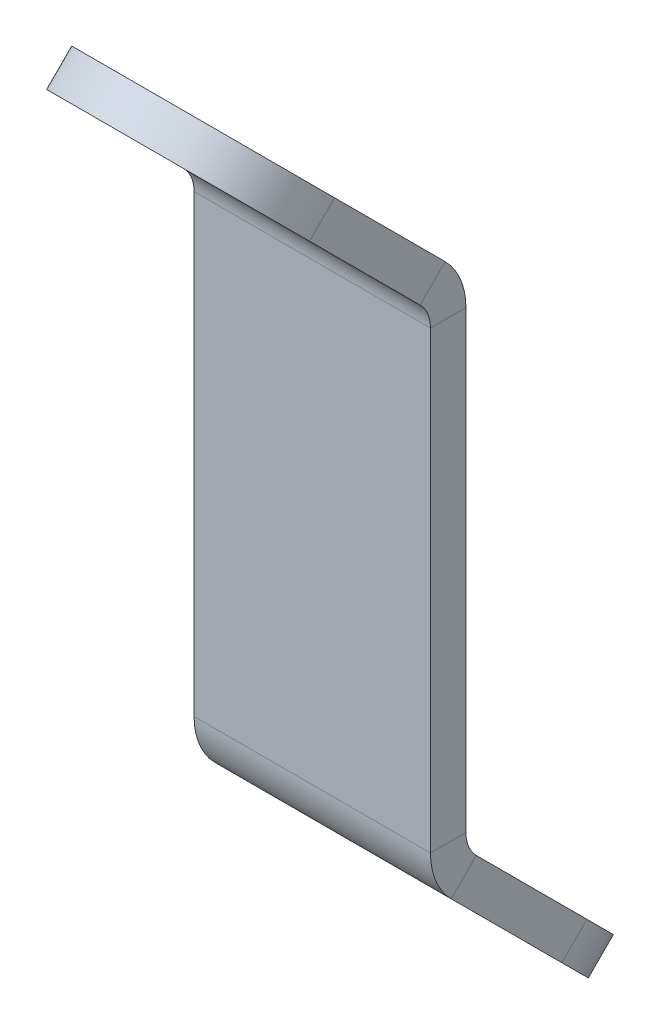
ISO-10303-21;
HEADER;
FILE_DESCRIPTION(('STEP AP214'),'2;1');
FILE_NAME('part.step','',(''),(''),'','','');
FILE_SCHEMA(('AUTOMOTIVE_DESIGN { 1 0 10303 214 1 1 1 1 }'));
ENDSEC;
DATA;
#1=APPLICATION_CONTEXT('core data for automotive mechanical design processes');
#2=APPLICATION_PROTOCOL_DEFINITION('international standard','automotive_design',2000,#1);
#3=PRODUCT_CONTEXT('',#1,'mechanical');
#4=PRODUCT('Part','Part','',(#3));
#5=PRODUCT_RELATED_PRODUCT_CATEGORY('part','',(#4));
#6=PRODUCT_DEFINITION_FORMATION('','',#4);
#7=PRODUCT_DEFINITION_CONTEXT('part definition',#1,'design');
#8=PRODUCT_DEFINITION('design','',#6,#7);
#9=PRODUCT_DEFINITION_SHAPE('','',#8);
#10=(LENGTH_UNIT() NAMED_UNIT(*) SI_UNIT(.MILLI.,.METRE.));
#11=(NAMED_UNIT(*) PLANE_ANGLE_UNIT() SI_UNIT($,.RADIAN.));
#12=(NAMED_UNIT(*) SI_UNIT($,.STERADIAN.) SOLID_ANGLE_UNIT());
#13=UNCERTAINTY_MEASURE_WITH_UNIT(LENGTH_MEASURE(1.E-05),#10,'distance_accuracy_value','');
#14=(GEOMETRIC_REPRESENTATION_CONTEXT(3) GLOBAL_UNCERTAINTY_ASSIGNED_CONTEXT((#13)) GLOBAL_UNIT_ASSIGNED_CONTEXT((#10,
#11,#12)) REPRESENTATION_CONTEXT('',''));
#15=CARTESIAN_POINT('',(0.,0.,0.));
#16=DIRECTION('',(0.,0.,1.));
#17=DIRECTION('',(1.,0.,0.));
#18=AXIS2_PLACEMENT_3D('',#15,#16,#17);
#19=CARTESIAN_POINT('',(0.,3.16746428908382,-8.11440020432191));
#20=DIRECTION('',(0.,0.707106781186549,-0.707106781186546));
#21=DIRECTION('',(-1.,0.,0.));
#22=AXIS2_PLACEMENT_3D('',#19,#20,#21);
#23=CYLINDRICAL_SURFACE('',#22,4.25);
#24=CARTESIAN_POINT('',(0.,3.16746428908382,-8.11440020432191));
#25=DIRECTION('',(0.,-0.707106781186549,0.707106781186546));
#26=DIRECTION('',(1.,0.,0.));
#27=AXIS2_PLACEMENT_3D('',#24,#25,#26);
#28=CIRCLE('',#27,4.25);
#29=CARTESIAN_POINT('',(4.25,3.16746428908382,-8.11440020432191));
#30=VERTEX_POINT('',#29);
#31=EDGE_CURVE('E214',#30,#30,#28,.T.);
#32=ORIENTED_EDGE('',*,*,#31,.T.);
#33=EDGE_LOOP('',(#32));
#34=FACE_BOUND('',#33,.T.);
#35=CARTESIAN_POINT('',(0.,5.28878463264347,-10.2357205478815));
#36=DIRECTION('',(0.,-0.707106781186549,0.707106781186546));
#37=DIRECTION('',(1.,0.,0.));
#38=AXIS2_PLACEMENT_3D('',#35,#36,#37);
#39=CIRCLE('',#38,4.25);
#40=CARTESIAN_POINT('',(4.25,5.28878463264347,-10.2357205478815));
#41=VERTEX_POINT('',#40);
#42=EDGE_CURVE('E11',#41,#41,#39,.T.);
#43=ORIENTED_EDGE('',*,*,#42,.F.);
#44=EDGE_LOOP('',(#43));
#45=FACE_BOUND('',#44,.T.);
#46=ADVANCED_FACE('F30',(#34,#45),#23,.F.);
#47=CARTESIAN_POINT('',(0.,3.16746428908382,-8.11440020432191));
#48=DIRECTION('',(0.,0.707106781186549,-0.707106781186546));
#49=DIRECTION('',(-1.,0.,0.));
#50=AXIS2_PLACEMENT_3D('',#47,#48,#49);
#51=CYLINDRICAL_SURFACE('',#50,10.);
#52=CARTESIAN_POINT('',(0.,5.28878463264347,-10.2357205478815));
#53=DIRECTION('',(0.,-0.707106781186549,0.707106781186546));
#54=DIRECTION('',(1.,0.,0.));
#55=AXIS2_PLACEMENT_3D('',#52,#53,#54);
#56=CIRCLE('',#55,10.);
#57=CARTESIAN_POINT('',(-10.,5.28878463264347,-10.2357205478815));
#58=VERTEX_POINT('',#57);
#59=CARTESIAN_POINT('',(10.,5.28878463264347,-10.2357205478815));
#60=VERTEX_POINT('',#59);
#61=EDGE_CURVE('E211',#58,#60,#56,.T.);
#62=ORIENTED_EDGE('',*,*,#61,.T.);
#63=DIRECTION('',(0.,0.707106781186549,-0.707106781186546));
#64=VECTOR('',#63,1.);
#65=CARTESIAN_POINT('',(10.,3.16746428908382,-8.11440020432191));
#66=LINE('',#65,#64);
#67=CARTESIAN_POINT('',(10.,3.16746428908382,-8.11440020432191));
#68=VERTEX_POINT('',#67);
#69=EDGE_CURVE('E204',#68,#60,#66,.T.);
#70=ORIENTED_EDGE('',*,*,#69,.F.);
#71=CARTESIAN_POINT('',(0.,3.16746428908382,-8.11440020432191));
#72=DIRECTION('',(0.,-0.707106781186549,0.707106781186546));
#73=DIRECTION('',(1.,0.,0.));
#74=AXIS2_PLACEMENT_3D('',#71,#72,#73);
#75=CIRCLE('',#74,10.);
#76=CARTESIAN_POINT('',(-10.,3.16746428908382,-8.11440020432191));
#77=VERTEX_POINT('',#76);
#78=EDGE_CURVE('E197',#77,#68,#75,.T.);
#79=ORIENTED_EDGE('',*,*,#78,.F.);
#80=DIRECTION('',(0.,0.707106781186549,-0.707106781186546));
#81=VECTOR('',#80,1.);
#82=CARTESIAN_POINT('',(-10.,3.16746428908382,-8.11440020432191));
#83=LINE('',#82,#81);
#84=EDGE_CURVE('E208',#77,#58,#83,.T.);
#85=ORIENTED_EDGE('',*,*,#84,.T.);
#86=EDGE_LOOP('',(#62,#70,#79,#85));
#87=FACE_BOUND('',#86,.T.);
#88=ADVANCED_FACE('F303',(#87),#51,.T.);
#89=CARTESIAN_POINT('',(9.99999999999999,54.0791525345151,42.7972880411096));
#90=DIRECTION('',(1.,0.,0.));
#91=DIRECTION('',(0.,0.707106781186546,0.707106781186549));
#92=AXIS2_PLACEMENT_3D('',#89,#90,#91);
#93=PLANE('',#92);
#94=DIRECTION('',(0.,-0.707106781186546,-0.707106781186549));
#95=VECTOR('',#94,1.);
#96=CARTESIAN_POINT('',(9.99999999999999,56.2004728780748,40.67596769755));
#97=LINE('',#96,#95);
#98=CARTESIAN_POINT('',(10.,14.6458255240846,-0.87867965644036));
#99=VERTEX_POINT('',#98);
#100=EDGE_CURVE('E40',#99,#60,#97,.T.);
#101=ORIENTED_EDGE('',*,*,#100,.F.);
#102=DIRECTION('',(0.,-0.707106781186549,0.707106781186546));
#103=VECTOR('',#102,1.);
#104=CARTESIAN_POINT('',(10.,12.524505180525,1.24264068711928));
#105=LINE('',#104,#103);
#106=CARTESIAN_POINT('',(10.,12.524505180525,1.24264068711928));
#107=VERTEX_POINT('',#106);
#108=EDGE_CURVE('E167',#99,#107,#105,.T.);
#109=ORIENTED_EDGE('',*,*,#108,.T.);
#110=DIRECTION('',(0.,-0.707106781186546,-0.707106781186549));
#111=VECTOR('',#110,1.);
#112=CARTESIAN_POINT('',(9.99999999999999,54.0791525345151,42.7972880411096));
#113=LINE('',#112,#111);
#114=EDGE_CURVE('E71',#107,#68,#113,.T.);
#115=ORIENTED_EDGE('',*,*,#114,.T.);
#116=ORIENTED_EDGE('',*,*,#69,.T.);
#117=EDGE_LOOP('',(#101,#109,#115,#116));
#118=FACE_BOUND('',#117,.T.);
#119=ADVANCED_FACE('F309',(#118),#93,.T.);
#120=CARTESIAN_POINT('',(0.,54.0791525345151,42.7972880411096));
#121=DIRECTION('',(0.,-0.707106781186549,0.707106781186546));
#122=DIRECTION('',(1.,0.,0.));
#123=AXIS2_PLACEMENT_3D('',#120,#121,#122);
#124=PLANE('',#123);
#125=ORIENTED_EDGE('',*,*,#31,.F.);
#126=EDGE_LOOP('',(#125));
#127=FACE_BOUND('',#126,.T.);
#128=ORIENTED_EDGE('',*,*,#114,.F.);
#129=DIRECTION('',(-1.,0.,0.));
#130=VECTOR('',#129,1.);
#131=CARTESIAN_POINT('',(0.,12.524505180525,1.24264068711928));
#132=LINE('',#131,#130);
#133=CARTESIAN_POINT('',(-10.,12.524505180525,1.24264068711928));
#134=VERTEX_POINT('',#133);
#135=EDGE_CURVE('E201',#107,#134,#132,.T.);
#136=ORIENTED_EDGE('',*,*,#135,.T.);
#137=DIRECTION('',(0.,-0.707106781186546,-0.707106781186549));
#138=VECTOR('',#137,1.);
#139=CARTESIAN_POINT('',(-10.,54.0791525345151,42.7972880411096));
#140=LINE('',#139,#138);
#141=EDGE_CURVE('E199',#134,#77,#140,.T.);
#142=ORIENTED_EDGE('',*,*,#141,.T.);
#143=ORIENTED_EDGE('',*,*,#78,.T.);
#144=EDGE_LOOP('',(#128,#136,#142,#143));
#145=FACE_BOUND('',#144,.T.);
#146=ADVANCED_FACE('F317',(#127,#145),#124,.T.);
#147=CARTESIAN_POINT('',(-10.,54.0791525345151,42.7972880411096));
#148=DIRECTION('',(1.,0.,0.));
#149=DIRECTION('',(0.,0.707106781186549,-0.707106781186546));
#150=AXIS2_PLACEMENT_3D('',#147,#148,#149);
#151=PLANE('',#150);
#152=DIRECTION('',(0.,-0.707106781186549,0.707106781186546));
#153=VECTOR('',#152,1.);
#154=CARTESIAN_POINT('',(-10.,12.524505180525,1.24264068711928));
#155=LINE('',#154,#153);
#156=CARTESIAN_POINT('',(-10.,14.6458255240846,-0.87867965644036));
#157=VERTEX_POINT('',#156);
#158=EDGE_CURVE('E216',#157,#134,#155,.T.);
#159=ORIENTED_EDGE('',*,*,#158,.F.);
#160=DIRECTION('',(0.,-0.707106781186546,-0.707106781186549));
#161=VECTOR('',#160,1.);
#162=CARTESIAN_POINT('',(-10.,56.2004728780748,40.67596769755));
#163=LINE('',#162,#161);
#164=EDGE_CURVE('E195',#157,#58,#163,.T.);
#165=ORIENTED_EDGE('',*,*,#164,.T.);
#166=ORIENTED_EDGE('',*,*,#84,.F.);
#167=ORIENTED_EDGE('',*,*,#141,.F.);
#168=EDGE_LOOP('',(#159,#165,#166,#167));
#169=FACE_BOUND('',#168,.T.);
#170=ADVANCED_FACE('F319',(#169),#151,.F.);
#171=CARTESIAN_POINT('',(0.,56.2004728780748,40.67596769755));
#172=DIRECTION('',(0.,-0.707106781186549,0.707106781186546));
#173=DIRECTION('',(1.,0.,0.));
#174=AXIS2_PLACEMENT_3D('',#171,#172,#173);
#175=PLANE('',#174);
#176=DIRECTION('',(-1.,0.,0.));
#177=VECTOR('',#176,1.);
#178=CARTESIAN_POINT('',(0.,14.6458255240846,-0.878679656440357));
#179=LINE('',#178,#177);
#180=EDGE_CURVE('E34',#99,#157,#179,.T.);
#181=ORIENTED_EDGE('',*,*,#180,.F.);
#182=ORIENTED_EDGE('',*,*,#100,.T.);
#183=ORIENTED_EDGE('',*,*,#61,.F.);
#184=ORIENTED_EDGE('',*,*,#164,.F.);
#185=EDGE_LOOP('',(#181,#182,#183,#184));
#186=FACE_BOUND('',#185,.T.);
#187=ORIENTED_EDGE('',*,*,#42,.T.);
#188=EDGE_LOOP('',(#187));
#189=FACE_BOUND('',#188,.T.);
#190=ADVANCED_FACE('F32',(#186,#189),#175,.F.);
#191=CARTESIAN_POINT('',(0.,66.7112153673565,13.2357205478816));
#192=DIRECTION('',(0.,0.707106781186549,-0.707106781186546));
#193=DIRECTION('',(-1.,0.,0.));
#194=AXIS2_PLACEMENT_3D('',#191,#192,#193);
#195=CYLINDRICAL_SURFACE('',#194,4.25000000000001);
#196=CARTESIAN_POINT('',(0.,66.7112153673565,13.2357205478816));
#197=DIRECTION('',(0.,-0.707106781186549,0.707106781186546));
#198=DIRECTION('',(1.,0.,0.));
#199=AXIS2_PLACEMENT_3D('',#196,#197,#198);
#200=CIRCLE('',#199,4.25000000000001);
#201=CARTESIAN_POINT('',(4.25000000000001,66.7112153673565,13.2357205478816));
#202=VERTEX_POINT('',#201);
#203=EDGE_CURVE('E245',#202,#202,#200,.T.);
#204=ORIENTED_EDGE('',*,*,#203,.T.);
#205=EDGE_LOOP('',(#204));
#206=FACE_BOUND('',#205,.T.);
#207=CARTESIAN_POINT('',(0.,68.8325357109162,11.1144002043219));
#208=DIRECTION('',(0.,-0.707106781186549,0.707106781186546));
#209=DIRECTION('',(1.,0.,0.));
#210=AXIS2_PLACEMENT_3D('',#207,#208,#209);
#211=CIRCLE('',#210,4.25000000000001);
#212=CARTESIAN_POINT('',(4.25000000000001,68.8325357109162,11.1144002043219));
#213=VERTEX_POINT('',#212);
#214=EDGE_CURVE('E230',#213,#213,#211,.T.);
#215=ORIENTED_EDGE('',*,*,#214,.F.);
#216=EDGE_LOOP('',(#215));
#217=FACE_BOUND('',#216,.T.);
#218=ADVANCED_FACE('F326',(#206,#217),#195,.F.);
#219=CARTESIAN_POINT('',(0.,66.7112153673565,13.2357205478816));
#220=DIRECTION('',(0.,0.707106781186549,-0.707106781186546));
#221=DIRECTION('',(-1.,0.,0.));
#222=AXIS2_PLACEMENT_3D('',#219,#220,#221);
#223=CYLINDRICAL_SURFACE('',#222,10.);
#224=CARTESIAN_POINT('',(0.,68.8325357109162,11.1144002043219));
#225=DIRECTION('',(0.,-0.707106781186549,0.707106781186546));
#226=DIRECTION('',(1.,0.,0.));
#227=AXIS2_PLACEMENT_3D('',#224,#225,#226);
#228=CIRCLE('',#227,10.);
#229=CARTESIAN_POINT('',(9.99999999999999,68.8325357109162,11.1144002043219));
#230=VERTEX_POINT('',#229);
#231=CARTESIAN_POINT('',(-10.,68.8325357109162,11.1144002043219));
#232=VERTEX_POINT('',#231);
#233=EDGE_CURVE('E242',#230,#232,#228,.T.);
#234=ORIENTED_EDGE('',*,*,#233,.T.);
#235=DIRECTION('',(0.,0.707106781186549,-0.707106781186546));
#236=VECTOR('',#235,1.);
#237=CARTESIAN_POINT('',(-10.,66.7112153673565,13.2357205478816));
#238=LINE('',#237,#236);
#239=CARTESIAN_POINT('',(-10.,66.7112153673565,13.2357205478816));
#240=VERTEX_POINT('',#239);
#241=EDGE_CURVE('E228',#240,#232,#238,.T.);
#242=ORIENTED_EDGE('',*,*,#241,.F.);
#243=CARTESIAN_POINT('',(0.,66.7112153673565,13.2357205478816));
#244=DIRECTION('',(0.,-0.707106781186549,0.707106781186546));
#245=DIRECTION('',(1.,0.,0.));
#246=AXIS2_PLACEMENT_3D('',#243,#244,#245);
#247=CIRCLE('',#246,10.);
#248=CARTESIAN_POINT('',(9.99999999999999,66.7112153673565,13.2357205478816));
#249=VERTEX_POINT('',#248);
#250=EDGE_CURVE('E218',#249,#240,#247,.T.);
#251=ORIENTED_EDGE('',*,*,#250,.F.);
#252=DIRECTION('',(0.,0.707106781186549,-0.707106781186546));
#253=VECTOR('',#252,1.);
#254=CARTESIAN_POINT('',(9.99999999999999,66.7112153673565,13.2357205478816));
#255=LINE('',#254,#253);
#256=EDGE_CURVE('E240',#249,#230,#255,.T.);
#257=ORIENTED_EDGE('',*,*,#256,.T.);
#258=EDGE_LOOP('',(#234,#242,#251,#257));
#259=FACE_BOUND('',#258,.T.);
#260=ADVANCED_FACE('F451',(#259),#223,.T.);
#261=CARTESIAN_POINT('',(9.99999999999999,66.7112153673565,13.2357205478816));
#262=DIRECTION('',(1.,0.,0.));
#263=DIRECTION('',(0.,0.707106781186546,0.707106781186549));
#264=AXIS2_PLACEMENT_3D('',#261,#262,#263);
#265=PLANE('',#264);
#266=DIRECTION('',(0.,-0.707106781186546,-0.707106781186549));
#267=VECTOR('',#266,1.);
#268=CARTESIAN_POINT('',(9.99999999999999,66.7112153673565,13.2357205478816));
#269=LINE('',#268,#267);
#270=CARTESIAN_POINT('',(9.99999999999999,57.3541744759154,3.87867965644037));
#271=VERTEX_POINT('',#270);
#272=EDGE_CURVE('E238',#249,#271,#269,.T.);
#273=ORIENTED_EDGE('',*,*,#272,.T.);
#274=DIRECTION('',(0.,0.707106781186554,-0.707106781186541));
#275=VECTOR('',#274,1.);
#276=CARTESIAN_POINT('',(9.99999999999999,57.3541744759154,3.87867965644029));
#277=LINE('',#276,#275);
#278=CARTESIAN_POINT('',(9.99999999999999,59.475494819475,1.75735931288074));
#279=VERTEX_POINT('',#278);
#280=EDGE_CURVE('E235',#271,#279,#277,.T.);
#281=ORIENTED_EDGE('',*,*,#280,.T.);
#282=DIRECTION('',(0.,-0.707106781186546,-0.707106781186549));
#283=VECTOR('',#282,1.);
#284=CARTESIAN_POINT('',(9.99999999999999,68.8325357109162,11.1144002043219));
#285=LINE('',#284,#283);
#286=EDGE_CURVE('E233',#230,#279,#285,.T.);
#287=ORIENTED_EDGE('',*,*,#286,.F.);
#288=ORIENTED_EDGE('',*,*,#256,.F.);
#289=EDGE_LOOP('',(#273,#281,#287,#288));
#290=FACE_BOUND('',#289,.T.);
#291=ADVANCED_FACE('F287',(#290),#265,.T.);
#292=CARTESIAN_POINT('',(0.,68.8325357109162,11.1144002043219));
#293=DIRECTION('',(0.,-0.707106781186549,0.707106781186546));
#294=DIRECTION('',(1.,0.,0.));
#295=AXIS2_PLACEMENT_3D('',#292,#293,#294);
#296=PLANE('',#295);
#297=DIRECTION('',(1.,0.,0.));
#298=VECTOR('',#297,1.);
#299=CARTESIAN_POINT('',(0.,59.475494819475,1.75735931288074));
#300=LINE('',#299,#298);
#301=CARTESIAN_POINT('',(-10.,59.475494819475,1.75735931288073));
#302=VERTEX_POINT('',#301);
#303=EDGE_CURVE('E100',#302,#279,#300,.T.);
#304=ORIENTED_EDGE('',*,*,#303,.F.);
#305=DIRECTION('',(0.,-0.707106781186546,-0.707106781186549));
#306=VECTOR('',#305,1.);
#307=CARTESIAN_POINT('',(-10.,68.8325357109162,11.1144002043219));
#308=LINE('',#307,#306);
#309=EDGE_CURVE('E226',#232,#302,#308,.T.);
#310=ORIENTED_EDGE('',*,*,#309,.F.);
#311=ORIENTED_EDGE('',*,*,#233,.F.);
#312=ORIENTED_EDGE('',*,*,#286,.T.);
#313=EDGE_LOOP('',(#304,#310,#311,#312));
#314=FACE_BOUND('',#313,.T.);
#315=ORIENTED_EDGE('',*,*,#214,.T.);
#316=EDGE_LOOP('',(#315));
#317=FACE_BOUND('',#316,.T.);
#318=ADVANCED_FACE('F298',(#314,#317),#296,.F.);
#319=CARTESIAN_POINT('',(-10.,66.7112153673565,13.2357205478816));
#320=DIRECTION('',(1.,0.,0.));
#321=DIRECTION('',(0.,0.707106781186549,-0.707106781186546));
#322=AXIS2_PLACEMENT_3D('',#319,#320,#321);
#323=PLANE('',#322);
#324=DIRECTION('',(0.,0.707106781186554,-0.707106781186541));
#325=VECTOR('',#324,1.);
#326=CARTESIAN_POINT('',(-10.,57.3541744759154,3.87867965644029));
#327=LINE('',#326,#325);
#328=CARTESIAN_POINT('',(-10.,57.3541744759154,3.87867965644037));
#329=VERTEX_POINT('',#328);
#330=EDGE_CURVE('E177',#329,#302,#327,.T.);
#331=ORIENTED_EDGE('',*,*,#330,.F.);
#332=DIRECTION('',(0.,-0.707106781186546,-0.707106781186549));
#333=VECTOR('',#332,1.);
#334=CARTESIAN_POINT('',(-10.,66.7112153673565,13.2357205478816));
#335=LINE('',#334,#333);
#336=EDGE_CURVE('E80',#240,#329,#335,.T.);
#337=ORIENTED_EDGE('',*,*,#336,.F.);
#338=ORIENTED_EDGE('',*,*,#241,.T.);
#339=ORIENTED_EDGE('',*,*,#309,.T.);
#340=EDGE_LOOP('',(#331,#337,#338,#339));
#341=FACE_BOUND('',#340,.T.);
#342=ADVANCED_FACE('F290',(#341),#323,.F.);
#343=CARTESIAN_POINT('',(0.,66.7112153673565,13.2357205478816));
#344=DIRECTION('',(0.,-0.707106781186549,0.707106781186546));
#345=DIRECTION('',(1.,0.,0.));
#346=AXIS2_PLACEMENT_3D('',#343,#344,#345);
#347=PLANE('',#346);
#348=ORIENTED_EDGE('',*,*,#203,.F.);
#349=EDGE_LOOP('',(#348));
#350=FACE_BOUND('',#349,.T.);
#351=ORIENTED_EDGE('',*,*,#336,.T.);
#352=DIRECTION('',(1.,0.,0.));
#353=VECTOR('',#352,1.);
#354=CARTESIAN_POINT('',(0.,57.3541744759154,3.87867965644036));
#355=LINE('',#354,#353);
#356=EDGE_CURVE('E106',#329,#271,#355,.T.);
#357=ORIENTED_EDGE('',*,*,#356,.T.);
#358=ORIENTED_EDGE('',*,*,#272,.F.);
#359=ORIENTED_EDGE('',*,*,#250,.T.);
#360=EDGE_LOOP('',(#351,#357,#358,#359));
#361=FACE_BOUND('',#360,.T.);
#362=ADVANCED_FACE('F288',(#350,#361),#347,.T.);
#363=CARTESIAN_POINT('',(0.,72.,0.));
#364=DIRECTION('',(0.,0.,1.));
#365=DIRECTION('',(1.,0.,0.));
#366=AXIS2_PLACEMENT_3D('',#363,#364,#365);
#367=PLANE('',#366);
#368=DIRECTION('',(0.,-1.,0.));
#369=VECTOR('',#368,1.);
#370=CARTESIAN_POINT('',(9.99999999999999,72.,0.));
#371=LINE('',#370,#369);
#372=CARTESIAN_POINT('',(9.99999999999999,55.2328541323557,0.));
#373=VERTEX_POINT('',#372);
#374=CARTESIAN_POINT('',(10.,16.7671458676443,0.));
#375=VERTEX_POINT('',#374);
#376=EDGE_CURVE('E174',#373,#375,#371,.T.);
#377=ORIENTED_EDGE('',*,*,#376,.T.);
#378=DIRECTION('',(-1.,0.,0.));
#379=VECTOR('',#378,1.);
#380=CARTESIAN_POINT('',(0.,16.7671458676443,0.));
#381=LINE('',#380,#379);
#382=CARTESIAN_POINT('',(-10.,16.7671458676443,0.));
#383=VERTEX_POINT('',#382);
#384=EDGE_CURVE('E148',#375,#383,#381,.T.);
#385=ORIENTED_EDGE('',*,*,#384,.T.);
#386=DIRECTION('',(0.,-1.,0.));
#387=VECTOR('',#386,1.);
#388=CARTESIAN_POINT('',(-10.,72.,0.));
#389=LINE('',#388,#387);
#390=CARTESIAN_POINT('',(-10.,55.2328541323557,0.));
#391=VERTEX_POINT('',#390);
#392=EDGE_CURVE('E183',#391,#383,#389,.T.);
#393=ORIENTED_EDGE('',*,*,#392,.F.);
#394=DIRECTION('',(1.,0.,0.));
#395=VECTOR('',#394,1.);
#396=CARTESIAN_POINT('',(0.,55.2328541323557,0.));
#397=LINE('',#396,#395);
#398=EDGE_CURVE('E181',#391,#373,#397,.T.);
#399=ORIENTED_EDGE('',*,*,#398,.T.);
#400=EDGE_LOOP('',(#377,#385,#393,#399));
#401=FACE_BOUND('',#400,.T.);
#402=ADVANCED_FACE('F180',(#401),#367,.F.);
#403=CARTESIAN_POINT('',(-10.,72.,3.));
#404=DIRECTION('',(1.,0.,0.));
#405=DIRECTION('',(0.,0.,-1.));
#406=AXIS2_PLACEMENT_3D('',#403,#404,#405);
#407=PLANE('',#406);
#408=ORIENTED_EDGE('',*,*,#392,.T.);
#409=DIRECTION('',(0.,0.,1.));
#410=VECTOR('',#409,1.);
#411=CARTESIAN_POINT('',(-10.,16.7671458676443,3.));
#412=LINE('',#411,#410);
#413=CARTESIAN_POINT('',(-10.,16.7671458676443,3.));
#414=VERTEX_POINT('',#413);
#415=EDGE_CURVE('E159',#383,#414,#412,.T.);
#416=ORIENTED_EDGE('',*,*,#415,.T.);
#417=DIRECTION('',(0.,-1.,0.));
#418=VECTOR('',#417,1.);
#419=CARTESIAN_POINT('',(-10.,72.,3.));
#420=LINE('',#419,#418);
#421=CARTESIAN_POINT('',(-10.,55.2328541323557,3.));
#422=VERTEX_POINT('',#421);
#423=EDGE_CURVE('E182',#422,#414,#420,.T.);
#424=ORIENTED_EDGE('',*,*,#423,.F.);
#425=DIRECTION('',(0.,0.,-1.));
#426=VECTOR('',#425,1.);
#427=CARTESIAN_POINT('',(-10.,55.2328541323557,2.99999999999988));
#428=LINE('',#427,#426);
#429=EDGE_CURVE('E192',#422,#391,#428,.T.);
#430=ORIENTED_EDGE('',*,*,#429,.T.);
#431=EDGE_LOOP('',(#408,#416,#424,#430));
#432=FACE_BOUND('',#431,.T.);
#433=ADVANCED_FACE('F275',(#432),#407,.F.);
#434=CARTESIAN_POINT('',(0.,72.,3.));
#435=DIRECTION('',(0.,0.,1.));
#436=DIRECTION('',(1.,0.,0.));
#437=AXIS2_PLACEMENT_3D('',#434,#435,#436);
#438=PLANE('',#437);
#439=DIRECTION('',(-1.,0.,0.));
#440=VECTOR('',#439,1.);
#441=CARTESIAN_POINT('',(0.,16.7671458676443,3.));
#442=LINE('',#441,#440);
#443=CARTESIAN_POINT('',(10.,16.7671458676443,3.));
#444=VERTEX_POINT('',#443);
#445=EDGE_CURVE('E158',#444,#414,#442,.T.);
#446=ORIENTED_EDGE('',*,*,#445,.F.);
#447=DIRECTION('',(0.,-1.,0.));
#448=VECTOR('',#447,1.);
#449=CARTESIAN_POINT('',(9.99999999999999,72.,3.));
#450=LINE('',#449,#448);
#451=CARTESIAN_POINT('',(9.99999999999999,55.2328541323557,3.));
#452=VERTEX_POINT('',#451);
#453=EDGE_CURVE('E176',#452,#444,#450,.T.);
#454=ORIENTED_EDGE('',*,*,#453,.F.);
#455=DIRECTION('',(1.,0.,0.));
#456=VECTOR('',#455,1.);
#457=CARTESIAN_POINT('',(0.,55.2328541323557,3.));
#458=LINE('',#457,#456);
#459=EDGE_CURVE('E264',#422,#452,#458,.T.);
#460=ORIENTED_EDGE('',*,*,#459,.F.);
#461=ORIENTED_EDGE('',*,*,#423,.T.);
#462=EDGE_LOOP('',(#446,#454,#460,#461));
#463=FACE_BOUND('',#462,.T.);
#464=ADVANCED_FACE('F277',(#463),#438,.T.);
#465=CARTESIAN_POINT('',(9.99999999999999,72.,3.));
#466=DIRECTION('',(1.,0.,0.));
#467=DIRECTION('',(0.,1.,0.));
#468=AXIS2_PLACEMENT_3D('',#465,#466,#467);
#469=PLANE('',#468);
#470=DIRECTION('',(0.,0.,1.));
#471=VECTOR('',#470,1.);
#472=CARTESIAN_POINT('',(10.,16.7671458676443,3.));
#473=LINE('',#472,#471);
#474=EDGE_CURVE('E165',#375,#444,#473,.T.);
#475=ORIENTED_EDGE('',*,*,#474,.F.);
#476=ORIENTED_EDGE('',*,*,#376,.F.);
#477=DIRECTION('',(0.,0.,-1.));
#478=VECTOR('',#477,1.);
#479=CARTESIAN_POINT('',(9.99999999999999,55.2328541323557,2.99999999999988));
#480=LINE('',#479,#478);
#481=EDGE_CURVE('E266',#452,#373,#480,.T.);
#482=ORIENTED_EDGE('',*,*,#481,.F.);
#483=ORIENTED_EDGE('',*,*,#453,.T.);
#484=EDGE_LOOP('',(#475,#476,#482,#483));
#485=FACE_BOUND('',#484,.T.);
#486=ADVANCED_FACE('F172',(#485),#469,.T.);
#487=CARTESIAN_POINT('',(9.99999999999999,55.2328541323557,6.));
#488=DIRECTION('',(1.,0.,0.));
#489=DIRECTION('',(0.,0.,-1.));
#490=AXIS2_PLACEMENT_3D('',#487,#488,#489);
#491=PLANE('',#490);
#492=ORIENTED_EDGE('',*,*,#280,.F.);
#493=CARTESIAN_POINT('',(9.99999999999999,55.2328541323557,6.));
#494=DIRECTION('',(-1.,0.,0.));
#495=DIRECTION('',(0.,0.,1.));
#496=AXIS2_PLACEMENT_3D('',#493,#494,#495);
#497=CIRCLE('',#496,3.);
#498=EDGE_CURVE('E255',#271,#452,#497,.T.);
#499=ORIENTED_EDGE('',*,*,#498,.T.);
#500=ORIENTED_EDGE('',*,*,#481,.T.);
#501=CARTESIAN_POINT('',(9.99999999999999,55.2328541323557,6.));
#502=DIRECTION('',(-1.,0.,0.));
#503=DIRECTION('',(0.,0.,1.));
#504=AXIS2_PLACEMENT_3D('',#501,#502,#503);
#505=CIRCLE('',#504,6.);
#506=EDGE_CURVE('E187',#279,#373,#505,.T.);
#507=ORIENTED_EDGE('',*,*,#506,.F.);
#508=EDGE_LOOP('',(#492,#499,#500,#507));
#509=FACE_BOUND('',#508,.T.);
#510=ADVANCED_FACE('F283',(#509),#491,.T.);
#511=CARTESIAN_POINT('',(-10.,55.2328541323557,6.));
#512=DIRECTION('',(1.,0.,0.));
#513=DIRECTION('',(0.,0.,-1.));
#514=AXIS2_PLACEMENT_3D('',#511,#512,#513);
#515=PLANE('',#514);
#516=ORIENTED_EDGE('',*,*,#429,.F.);
#517=CARTESIAN_POINT('',(-10.,55.2328541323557,6.));
#518=DIRECTION('',(-1.,0.,0.));
#519=DIRECTION('',(0.,0.,1.));
#520=AXIS2_PLACEMENT_3D('',#517,#518,#519);
#521=CIRCLE('',#520,3.);
#522=EDGE_CURVE('E252',#329,#422,#521,.T.);
#523=ORIENTED_EDGE('',*,*,#522,.F.);
#524=ORIENTED_EDGE('',*,*,#330,.T.);
#525=CARTESIAN_POINT('',(-10.,55.2328541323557,6.));
#526=DIRECTION('',(-1.,0.,0.));
#527=DIRECTION('',(0.,0.,1.));
#528=AXIS2_PLACEMENT_3D('',#525,#526,#527);
#529=CIRCLE('',#528,6.);
#530=EDGE_CURVE('E117',#302,#391,#529,.T.);
#531=ORIENTED_EDGE('',*,*,#530,.T.);
#532=EDGE_LOOP('',(#516,#523,#524,#531));
#533=FACE_BOUND('',#532,.T.);
#534=ADVANCED_FACE('F250',(#533),#515,.F.);
#535=CARTESIAN_POINT('',(104.196602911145,55.2328541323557,6.));
#536=DIRECTION('',(-1.,0.,0.));
#537=DIRECTION('',(0.,0.,1.));
#538=AXIS2_PLACEMENT_3D('',#535,#536,#537);
#539=CYLINDRICAL_SURFACE('',#538,6.);
#540=ORIENTED_EDGE('',*,*,#530,.F.);
#541=ORIENTED_EDGE('',*,*,#303,.T.);
#542=ORIENTED_EDGE('',*,*,#506,.T.);
#543=ORIENTED_EDGE('',*,*,#398,.F.);
#544=EDGE_LOOP('',(#540,#541,#542,#543));
#545=FACE_BOUND('',#544,.T.);
#546=ADVANCED_FACE('F253',(#545),#539,.T.);
#547=CARTESIAN_POINT('',(104.196602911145,55.2328541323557,6.));
#548=DIRECTION('',(-1.,0.,0.));
#549=DIRECTION('',(0.,0.,1.));
#550=AXIS2_PLACEMENT_3D('',#547,#548,#549);
#551=CYLINDRICAL_SURFACE('',#550,3.);
#552=ORIENTED_EDGE('',*,*,#522,.T.);
#553=ORIENTED_EDGE('',*,*,#459,.T.);
#554=ORIENTED_EDGE('',*,*,#498,.F.);
#555=ORIENTED_EDGE('',*,*,#356,.F.);
#556=EDGE_LOOP('',(#552,#553,#554,#555));
#557=FACE_BOUND('',#556,.T.);
#558=ADVANCED_FACE('F280',(#557),#551,.F.);
#559=CARTESIAN_POINT('',(10.,16.7671458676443,-3.));
#560=DIRECTION('',(-1.,0.,0.));
#561=DIRECTION('',(0.,0.,1.));
#562=AXIS2_PLACEMENT_3D('',#559,#560,#561);
#563=PLANE('',#562);
#564=ORIENTED_EDGE('',*,*,#108,.F.);
#565=CARTESIAN_POINT('',(10.,16.7671458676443,-3.));
#566=DIRECTION('',(-1.,0.,0.));
#567=DIRECTION('',(0.,0.,1.));
#568=AXIS2_PLACEMENT_3D('',#565,#566,#567);
#569=CIRCLE('',#568,3.);
#570=EDGE_CURVE('E151',#375,#99,#569,.F.);
#571=ORIENTED_EDGE('',*,*,#570,.F.);
#572=ORIENTED_EDGE('',*,*,#474,.T.);
#573=CARTESIAN_POINT('',(10.,16.7671458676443,-3.));
#574=DIRECTION('',(-1.,0.,0.));
#575=DIRECTION('',(0.,0.,1.));
#576=AXIS2_PLACEMENT_3D('',#573,#574,#575);
#577=CIRCLE('',#576,6.);
#578=EDGE_CURVE('E271',#444,#107,#577,.F.);
#579=ORIENTED_EDGE('',*,*,#578,.T.);
#580=EDGE_LOOP('',(#564,#571,#572,#579));
#581=FACE_BOUND('',#580,.T.);
#582=ADVANCED_FACE('F163',(#581),#563,.F.);
#583=CARTESIAN_POINT('',(-10.,16.7671458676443,-3.));
#584=DIRECTION('',(-1.,0.,0.));
#585=DIRECTION('',(0.,0.,1.));
#586=AXIS2_PLACEMENT_3D('',#583,#584,#585);
#587=PLANE('',#586);
#588=CARTESIAN_POINT('',(-10.,16.7671458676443,-3.));
#589=DIRECTION('',(-1.,0.,0.));
#590=DIRECTION('',(0.,0.,1.));
#591=AXIS2_PLACEMENT_3D('',#588,#589,#590);
#592=CIRCLE('',#591,3.);
#593=EDGE_CURVE('E153',#383,#157,#592,.F.);
#594=ORIENTED_EDGE('',*,*,#593,.T.);
#595=ORIENTED_EDGE('',*,*,#158,.T.);
#596=CARTESIAN_POINT('',(-10.,16.7671458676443,-3.));
#597=DIRECTION('',(-1.,0.,0.));
#598=DIRECTION('',(0.,0.,1.));
#599=AXIS2_PLACEMENT_3D('',#596,#597,#598);
#600=CIRCLE('',#599,6.);
#601=EDGE_CURVE('E64',#414,#134,#600,.F.);
#602=ORIENTED_EDGE('',*,*,#601,.F.);
#603=ORIENTED_EDGE('',*,*,#415,.F.);
#604=EDGE_LOOP('',(#594,#595,#602,#603));
#605=FACE_BOUND('',#604,.T.);
#606=ADVANCED_FACE('F337',(#605),#587,.T.);
#607=CARTESIAN_POINT('',(100.508534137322,16.7671458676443,-3.));
#608=DIRECTION('',(-1.,0.,0.));
#609=DIRECTION('',(0.,0.,1.));
#610=AXIS2_PLACEMENT_3D('',#607,#608,#609);
#611=CYLINDRICAL_SURFACE('',#610,6.);
#612=ORIENTED_EDGE('',*,*,#445,.T.);
#613=ORIENTED_EDGE('',*,*,#601,.T.);
#614=ORIENTED_EDGE('',*,*,#135,.F.);
#615=ORIENTED_EDGE('',*,*,#578,.F.);
#616=EDGE_LOOP('',(#612,#613,#614,#615));
#617=FACE_BOUND('',#616,.T.);
#618=ADVANCED_FACE('F270',(#617),#611,.T.);
#619=CARTESIAN_POINT('',(100.508534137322,16.7671458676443,-3.));
#620=DIRECTION('',(-1.,0.,0.));
#621=DIRECTION('',(0.,0.,1.));
#622=AXIS2_PLACEMENT_3D('',#619,#620,#621);
#623=CYLINDRICAL_SURFACE('',#622,3.);
#624=ORIENTED_EDGE('',*,*,#384,.F.);
#625=ORIENTED_EDGE('',*,*,#570,.T.);
#626=ORIENTED_EDGE('',*,*,#180,.T.);
#627=ORIENTED_EDGE('',*,*,#593,.F.);
#628=EDGE_LOOP('',(#624,#625,#626,#627));
#629=FACE_BOUND('',#628,.T.);
#630=ADVANCED_FACE('F150',(#629),#623,.F.);
#631=CLOSED_SHELL('',(#46,#88,#119,#146,#170,#190,#218,#260,#291,#318,#342,#362,#402,#433,#464,
#486,#510,#534,#546,#558,#582,#606,#618,#630));
#632=MANIFOLD_SOLID_BREP('B2',#631);
#633=ADVANCED_BREP_SHAPE_REPRESENTATION('',(#18,#632),#14);
#634=SHAPE_DEFINITION_REPRESENTATION(#9,#633);
ENDSEC;
END-ISO-10303-21;
